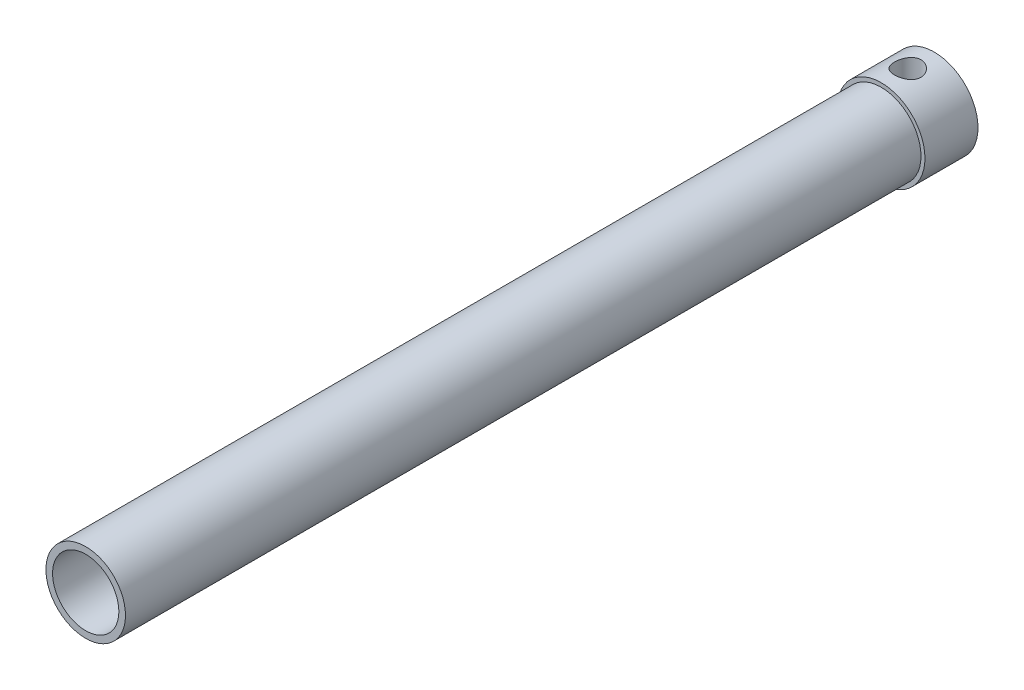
ISO-10303-21;
HEADER;
FILE_DESCRIPTION(('STEP AP214'),'2;1');
FILE_NAME('part.step','',(''),(''),'','','');
FILE_SCHEMA(('AUTOMOTIVE_DESIGN { 1 0 10303 214 1 1 1 1 }'));
ENDSEC;
DATA;
#1=APPLICATION_CONTEXT('core data for automotive mechanical design processes');
#2=APPLICATION_PROTOCOL_DEFINITION('international standard','automotive_design',2000,#1);
#3=PRODUCT_CONTEXT('',#1,'mechanical');
#4=PRODUCT('Part','Part','',(#3));
#5=PRODUCT_RELATED_PRODUCT_CATEGORY('part','',(#4));
#6=PRODUCT_DEFINITION_FORMATION('','',#4);
#7=PRODUCT_DEFINITION_CONTEXT('part definition',#1,'design');
#8=PRODUCT_DEFINITION('design','',#6,#7);
#9=PRODUCT_DEFINITION_SHAPE('','',#8);
#10=(LENGTH_UNIT() NAMED_UNIT(*) SI_UNIT(.MILLI.,.METRE.));
#11=(NAMED_UNIT(*) PLANE_ANGLE_UNIT() SI_UNIT($,.RADIAN.));
#12=(NAMED_UNIT(*) SI_UNIT($,.STERADIAN.) SOLID_ANGLE_UNIT());
#13=UNCERTAINTY_MEASURE_WITH_UNIT(LENGTH_MEASURE(1.E-05),#10,'distance_accuracy_value','');
#14=(GEOMETRIC_REPRESENTATION_CONTEXT(3) GLOBAL_UNCERTAINTY_ASSIGNED_CONTEXT((#13)) GLOBAL_UNIT_ASSIGNED_CONTEXT((#10,
#11,#12)) REPRESENTATION_CONTEXT('',''));
#15=CARTESIAN_POINT('',(0.,0.,0.));
#16=DIRECTION('',(0.,0.,1.));
#17=DIRECTION('',(1.,0.,0.));
#18=AXIS2_PLACEMENT_3D('',#15,#16,#17);
#19=CARTESIAN_POINT('',(0.,0.,300.));
#20=DIRECTION('',(0.,0.,-1.));
#21=DIRECTION('',(-1.,0.,0.));
#22=AXIS2_PLACEMENT_3D('',#19,#20,#21);
#23=CYLINDRICAL_SURFACE('',#22,15.);
#24=CARTESIAN_POINT('',(0.,0.,300.));
#25=DIRECTION('',(0.,0.,1.));
#26=DIRECTION('',(1.,0.,0.));
#27=AXIS2_PLACEMENT_3D('',#24,#25,#26);
#28=CIRCLE('',#27,15.);
#29=CARTESIAN_POINT('',(15.,0.,300.));
#30=VERTEX_POINT('',#29);
#31=EDGE_CURVE('E10',#30,#30,#28,.T.);
#32=ORIENTED_EDGE('',*,*,#31,.F.);
#33=EDGE_LOOP('',(#32));
#34=FACE_BOUND('',#33,.T.);
#35=CARTESIAN_POINT('',(0.,0.,0.));
#36=DIRECTION('',(0.,0.,1.));
#37=DIRECTION('',(1.,0.,0.));
#38=AXIS2_PLACEMENT_3D('',#35,#36,#37);
#39=CIRCLE('',#38,15.);
#40=CARTESIAN_POINT('',(15.,0.,0.));
#41=VERTEX_POINT('',#40);
#42=EDGE_CURVE('E50',#41,#41,#39,.T.);
#43=ORIENTED_EDGE('',*,*,#42,.T.);
#44=EDGE_LOOP('',(#43));
#45=FACE_BOUND('',#44,.T.);
#46=ADVANCED_FACE('F37',(#34,#45),#23,.T.);
#47=CARTESIAN_POINT('',(0.,0.,300.));
#48=DIRECTION('',(0.,0.,1.));
#49=DIRECTION('',(1.,0.,0.));
#50=AXIS2_PLACEMENT_3D('',#47,#48,#49);
#51=PLANE('',#50);
#52=CARTESIAN_POINT('',(0.,0.,300.));
#53=DIRECTION('',(0.,0.,1.));
#54=DIRECTION('',(1.,0.,0.));
#55=AXIS2_PLACEMENT_3D('',#52,#53,#54);
#56=CIRCLE('',#55,12.5);
#57=CARTESIAN_POINT('',(12.5,0.,300.));
#58=VERTEX_POINT('',#57);
#59=EDGE_CURVE('E66',#58,#58,#56,.T.);
#60=ORIENTED_EDGE('',*,*,#59,.F.);
#61=EDGE_LOOP('',(#60));
#62=FACE_BOUND('',#61,.T.);
#63=ORIENTED_EDGE('',*,*,#31,.T.);
#64=EDGE_LOOP('',(#63));
#65=FACE_BOUND('',#64,.T.);
#66=ADVANCED_FACE('F89',(#62,#65),#51,.T.);
#67=CARTESIAN_POINT('',(0.,0.,-20.));
#68=DIRECTION('',(0.,0.,1.));
#69=DIRECTION('',(1.,0.,0.));
#70=AXIS2_PLACEMENT_3D('',#67,#68,#69);
#71=CYLINDRICAL_SURFACE('',#70,16.5);
#72=CARTESIAN_POINT('',(0.,16.5,-5.));
#73=CARTESIAN_POINT('',(0.27416656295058,16.499997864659,-5.00000297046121));
#74=CARTESIAN_POINT('',(0.548363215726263,16.4931014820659,-5.02262484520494));
#75=CARTESIAN_POINT('',(1.08876356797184,16.4662646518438,-5.11229452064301));
#76=CARTESIAN_POINT('',(1.35496499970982,16.4463205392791,-5.17935480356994));
#77=CARTESIAN_POINT('',(1.87150278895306,16.3955720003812,-5.35545075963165));
#78=CARTESIAN_POINT('',(2.12186218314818,16.3647837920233,-5.4644237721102));
#79=CARTESIAN_POINT('',(2.60075521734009,16.2955420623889,-5.72099257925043));
#80=CARTESIAN_POINT('',(2.82928581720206,16.257087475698,-5.86859374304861));
#81=CARTESIAN_POINT('',(3.26471495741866,16.1753529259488,-6.20277426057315));
#82=CARTESIAN_POINT('',(3.47088543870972,16.1319725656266,-6.39027763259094));
#83=CARTESIAN_POINT('',(3.84938917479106,16.0458704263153,-6.79697111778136));
#84=CARTESIAN_POINT('',(4.02171659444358,16.003148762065,-7.01616668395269));
#85=CARTESIAN_POINT('',(4.33150150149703,15.9221353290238,-7.48621682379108));
#86=CARTESIAN_POINT('',(4.46806535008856,15.883968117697,-7.73768383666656));
#87=CARTESIAN_POINT('',(4.69666762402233,15.8178878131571,-8.26135758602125));
#88=CARTESIAN_POINT('',(4.78871698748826,15.7899722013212,-8.53355920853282));
#89=CARTESIAN_POINT('',(4.92304273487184,15.748602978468,-9.08279016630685));
#90=CARTESIAN_POINT('',(4.96666335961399,15.7347597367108,-9.35946059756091));
#91=CARTESIAN_POINT('',(5.00709144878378,15.7219440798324,-9.91651244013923));
#92=CARTESIAN_POINT('',(5.00391051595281,15.7229679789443,-10.1968929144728));
#93=CARTESIAN_POINT('',(4.95188056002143,15.7394259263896,-10.7424297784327));
#94=CARTESIAN_POINT('',(4.90472150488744,15.7543266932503,-11.0077661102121));
#95=CARTESIAN_POINT('',(4.76880670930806,15.7959958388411,-11.5265684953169));
#96=CARTESIAN_POINT('',(4.68004678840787,15.8227654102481,-11.7800333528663));
#97=CARTESIAN_POINT('',(4.46221737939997,15.8855774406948,-12.2720056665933));
#98=CARTESIAN_POINT('',(4.33260397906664,15.9217437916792,-12.5102558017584));
#99=CARTESIAN_POINT('',(4.03712482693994,15.9992154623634,-12.9621878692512));
#100=CARTESIAN_POINT('',(3.87125013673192,16.0405220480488,-13.1758637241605));
#101=CARTESIAN_POINT('',(3.49958783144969,16.125777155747,-13.5821595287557));
#102=CARTESIAN_POINT('',(3.29239951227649,16.1697632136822,-13.7734925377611));
#103=CARTESIAN_POINT('',(2.84832978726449,16.2538615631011,-14.1190003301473));
#104=CARTESIAN_POINT('',(2.61144643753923,16.2939736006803,-14.2731726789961));
#105=CARTESIAN_POINT('',(2.11233821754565,16.3661834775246,-14.540785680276));
#106=CARTESIAN_POINT('',(1.84994861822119,16.3982236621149,-14.6539357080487));
#107=CARTESIAN_POINT('',(1.30866646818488,16.4502641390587,-14.8341173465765));
#108=CARTESIAN_POINT('',(1.02977864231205,16.4702678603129,-14.9011620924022));
#109=CARTESIAN_POINT('',(0.474353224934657,16.4954369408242,-14.985075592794));
#110=CARTESIAN_POINT('',(0.198102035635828,16.5011177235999,-15.0036880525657));
#111=CARTESIAN_POINT('',(-0.353597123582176,16.4985159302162,-14.99510293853));
#112=CARTESIAN_POINT('',(-0.629045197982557,16.4902352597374,-14.9679116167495));
#113=CARTESIAN_POINT('',(-1.16470330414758,16.4609787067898,-14.869898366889));
#114=CARTESIAN_POINT('',(-1.42511840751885,16.4403007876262,-14.8000997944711));
#115=CARTESIAN_POINT('',(-1.93048096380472,16.388649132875,-14.6200887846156));
#116=CARTESIAN_POINT('',(-2.17542653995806,16.3576741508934,-14.5098714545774));
#117=CARTESIAN_POINT('',(-2.64927766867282,16.2877277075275,-14.2492534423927));
#118=CARTESIAN_POINT('',(-2.87767261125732,16.2485858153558,-14.097971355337));
#119=CARTESIAN_POINT('',(-3.30642612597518,16.1667951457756,-13.7605859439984));
#120=CARTESIAN_POINT('',(-3.50677750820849,16.1241454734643,-13.5744737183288));
#121=CARTESIAN_POINT('',(-3.88146430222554,16.0381606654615,-13.1645160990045));
#122=CARTESIAN_POINT('',(-4.05455854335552,15.9948588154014,-12.9395268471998));
#123=CARTESIAN_POINT('',(-4.36062787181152,15.914146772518,-12.4627539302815));
#124=CARTESIAN_POINT('',(-4.49360392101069,15.87673643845,-12.2109709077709));
#125=CARTESIAN_POINT('',(-4.71477026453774,15.8124706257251,-11.6884965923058));
#126=CARTESIAN_POINT('',(-4.80316154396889,15.7855679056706,-11.4178965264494));
#127=CARTESIAN_POINT('',(-4.93284562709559,15.7455304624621,-10.8646819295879));
#128=CARTESIAN_POINT('',(-4.97415499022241,15.732390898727,-10.5820716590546));
#129=CARTESIAN_POINT('',(-5.00736143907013,15.7218509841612,-10.0257720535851));
#130=CARTESIAN_POINT('',(-5.00128483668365,15.7238051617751,-9.75221434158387));
#131=CARTESIAN_POINT('',(-4.94474176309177,15.7416767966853,-9.21021403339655));
#132=CARTESIAN_POINT('',(-4.89427713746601,15.7575936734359,-8.94177122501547));
#133=CARTESIAN_POINT('',(-4.75171037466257,15.8011599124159,-8.42100744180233));
#134=CARTESIAN_POINT('',(-4.660155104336,15.8286548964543,-8.16852287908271));
#135=CARTESIAN_POINT('',(-4.43843275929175,15.8922482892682,-7.68229661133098));
#136=CARTESIAN_POINT('',(-4.30825817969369,15.9283483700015,-7.44855856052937));
#137=CARTESIAN_POINT('',(-4.00734203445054,16.0067548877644,-6.99708364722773));
#138=CARTESIAN_POINT('',(-3.83527527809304,16.0492418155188,-6.78026142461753));
#139=CARTESIAN_POINT('',(-3.45783157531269,16.1347696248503,-6.3779118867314));
#140=CARTESIAN_POINT('',(-3.25244592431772,16.1778106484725,-6.19239277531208));
#141=CARTESIAN_POINT('',(-2.80676565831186,16.2611473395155,-5.85235596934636));
#142=CARTESIAN_POINT('',(-2.56560775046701,16.301321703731,-5.69893691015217));
#143=CARTESIAN_POINT('',(-2.05970384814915,16.3729264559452,-5.43503282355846));
#144=CARTESIAN_POINT('',(-1.79496853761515,16.4043607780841,-5.32452847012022));
#145=CARTESIAN_POINT('',(-1.27725626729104,16.4523310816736,-5.15905013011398));
#146=CARTESIAN_POINT('',(-1.02582323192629,16.4700574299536,-5.09957036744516));
#147=CARTESIAN_POINT('',(-0.516268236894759,16.4938918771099,-5.0200473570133));
#148=CARTESIAN_POINT('',(-0.258147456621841,16.5000020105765,-4.999997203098));
#149=CARTESIAN_POINT('',(0.,16.5,-5.));
#150=B_SPLINE_CURVE_WITH_KNOTS('',3,(#72,#73,#74,#75,#76,#77,#78,#79,#80,#81,#82,#83,#84,#85,
#86,#87,#88,#89,#90,#91,#92,#93,#94,#95,#96,#97,#98,#99,#100,#101,#102,#103,#104,#105,#106,#107,
#108,#109,#110,#111,#112,#113,#114,#115,#116,#117,#118,#119,#120,#121,#122,#123,#124,#125,#126,
#127,#128,#129,#130,#131,#132,#133,#134,#135,#136,#137,#138,#139,#140,#141,#142,#143,#144,#145,
#146,#147,#148,#149),.UNSPECIFIED.,.T.,.F.,(4,2,2,2,2,2,2,2,2,2,2,2,2,2,2,2,2,2,2,2,2,2,2,2,2,2,
2,2,2,2,2,2,2,2,2,2,2,2,4),(0.,0.82155130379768,1.64333346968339,2.46389179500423,
3.28456423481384,4.12684629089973,4.96927344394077,5.83108565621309,6.69268599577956,
7.52972147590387,8.36654944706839,9.1724896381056,9.9785108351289,10.7957518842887,
11.6131946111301,12.4655059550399,13.3178731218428,14.1761660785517,15.0342144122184,
15.8609136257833,16.6875000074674,17.49497421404,18.302546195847,19.1290491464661,
19.9557636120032,20.8131534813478,21.6705227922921,22.5239918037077,23.3771605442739,
24.194052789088,25.0109110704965,25.8172062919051,26.6236583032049,27.4600121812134,
28.2965849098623,29.1582870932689,30.0196007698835,30.7932856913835,31.5668350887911),.UNSPECIFIED.);
#151=CARTESIAN_POINT('',(0.,16.5,-5.));
#152=VERTEX_POINT('',#151);
#153=EDGE_CURVE('E40',#152,#152,#150,.T.);
#154=ORIENTED_EDGE('',*,*,#153,.F.);
#155=EDGE_LOOP('',(#154));
#156=FACE_BOUND('',#155,.T.);
#157=CARTESIAN_POINT('',(0.,0.,-20.));
#158=DIRECTION('',(0.,0.,1.));
#159=DIRECTION('',(1.,0.,0.));
#160=AXIS2_PLACEMENT_3D('',#157,#158,#159);
#161=CIRCLE('',#160,16.5);
#162=CARTESIAN_POINT('',(16.5,0.,-20.));
#163=VERTEX_POINT('',#162);
#164=EDGE_CURVE('E56',#163,#163,#161,.T.);
#165=ORIENTED_EDGE('',*,*,#164,.T.);
#166=EDGE_LOOP('',(#165));
#167=FACE_BOUND('',#166,.T.);
#168=CARTESIAN_POINT('',(0.,0.,0.));
#169=DIRECTION('',(0.,0.,1.));
#170=DIRECTION('',(1.,0.,0.));
#171=AXIS2_PLACEMENT_3D('',#168,#169,#170);
#172=CIRCLE('',#171,16.5);
#173=CARTESIAN_POINT('',(16.5,0.,0.));
#174=VERTEX_POINT('',#173);
#175=EDGE_CURVE('E58',#174,#174,#172,.T.);
#176=ORIENTED_EDGE('',*,*,#175,.F.);
#177=EDGE_LOOP('',(#176));
#178=FACE_BOUND('',#177,.T.);
#179=ADVANCED_FACE('F85',(#156,#167,#178),#71,.T.);
#180=CARTESIAN_POINT('',(0.,0.,-20.));
#181=DIRECTION('',(0.,0.,1.));
#182=DIRECTION('',(1.,0.,0.));
#183=AXIS2_PLACEMENT_3D('',#180,#181,#182);
#184=PLANE('',#183);
#185=ORIENTED_EDGE('',*,*,#164,.F.);
#186=EDGE_LOOP('',(#185));
#187=FACE_BOUND('',#186,.T.);
#188=ADVANCED_FACE('F88',(#187),#184,.F.);
#189=CARTESIAN_POINT('',(0.,0.,0.));
#190=DIRECTION('',(0.,0.,1.));
#191=DIRECTION('',(1.,0.,0.));
#192=AXIS2_PLACEMENT_3D('',#189,#190,#191);
#193=PLANE('',#192);
#194=ORIENTED_EDGE('',*,*,#42,.F.);
#195=EDGE_LOOP('',(#194));
#196=FACE_BOUND('',#195,.T.);
#197=ORIENTED_EDGE('',*,*,#175,.T.);
#198=EDGE_LOOP('',(#197));
#199=FACE_BOUND('',#198,.T.);
#200=ADVANCED_FACE('F94',(#196,#199),#193,.T.);
#201=CARTESIAN_POINT('',(0.,0.,225.));
#202=DIRECTION('',(0.,0.,1.));
#203=DIRECTION('',(1.,0.,0.));
#204=AXIS2_PLACEMENT_3D('',#201,#202,#203);
#205=CYLINDRICAL_SURFACE('',#204,12.5);
#206=CARTESIAN_POINT('',(0.,0.,225.));
#207=DIRECTION('',(0.,0.,1.));
#208=DIRECTION('',(1.,0.,0.));
#209=AXIS2_PLACEMENT_3D('',#206,#207,#208);
#210=CIRCLE('',#209,12.5);
#211=CARTESIAN_POINT('',(12.5,0.,225.));
#212=VERTEX_POINT('',#211);
#213=EDGE_CURVE('E62',#212,#212,#210,.T.);
#214=ORIENTED_EDGE('',*,*,#213,.F.);
#215=EDGE_LOOP('',(#214));
#216=FACE_BOUND('',#215,.T.);
#217=ORIENTED_EDGE('',*,*,#59,.T.);
#218=EDGE_LOOP('',(#217));
#219=FACE_BOUND('',#218,.T.);
#220=ADVANCED_FACE('F96',(#216,#219),#205,.F.);
#221=CARTESIAN_POINT('',(0.,0.,225.));
#222=DIRECTION('',(0.,0.,1.));
#223=DIRECTION('',(1.,0.,0.));
#224=AXIS2_PLACEMENT_3D('',#221,#222,#223);
#225=PLANE('',#224);
#226=ORIENTED_EDGE('',*,*,#213,.T.);
#227=EDGE_LOOP('',(#226));
#228=FACE_BOUND('',#227,.T.);
#229=ADVANCED_FACE('F103',(#228),#225,.T.);
#230=CARTESIAN_POINT('',(0.,0.,-10.));
#231=DIRECTION('',(0.,1.,0.));
#232=DIRECTION('',(0.,0.,1.));
#233=AXIS2_PLACEMENT_3D('',#230,#231,#232);
#234=CYLINDRICAL_SURFACE('',#233,5.);
#235=ORIENTED_EDGE('',*,*,#153,.T.);
#236=EDGE_LOOP('',(#235));
#237=FACE_BOUND('',#236,.T.);
#238=CARTESIAN_POINT('',(0.,0.,-10.));
#239=DIRECTION('',(0.,1.,0.));
#240=DIRECTION('',(0.,0.,1.));
#241=AXIS2_PLACEMENT_3D('',#238,#239,#240);
#242=CIRCLE('',#241,5.);
#243=CARTESIAN_POINT('',(0.,0.,-5.));
#244=VERTEX_POINT('',#243);
#245=EDGE_CURVE('E73',#244,#244,#242,.T.);
#246=ORIENTED_EDGE('',*,*,#245,.F.);
#247=EDGE_LOOP('',(#246));
#248=FACE_BOUND('',#247,.T.);
#249=ADVANCED_FACE('F82',(#237,#248),#234,.F.);
#250=CARTESIAN_POINT('',(0.,0.,-10.));
#251=DIRECTION('',(0.,1.,0.));
#252=DIRECTION('',(0.,0.,1.));
#253=AXIS2_PLACEMENT_3D('',#250,#251,#252);
#254=PLANE('',#253);
#255=ORIENTED_EDGE('',*,*,#245,.T.);
#256=EDGE_LOOP('',(#255));
#257=FACE_BOUND('',#256,.T.);
#258=ADVANCED_FACE('F158',(#257),#254,.T.);
#259=CLOSED_SHELL('',(#46,#66,#179,#188,#200,#220,#229,#249,#258));
#260=MANIFOLD_SOLID_BREP('B2',#259);
#261=ADVANCED_BREP_SHAPE_REPRESENTATION('',(#18,#260),#14);
#262=SHAPE_DEFINITION_REPRESENTATION(#9,#261);
ENDSEC;
END-ISO-10303-21;
